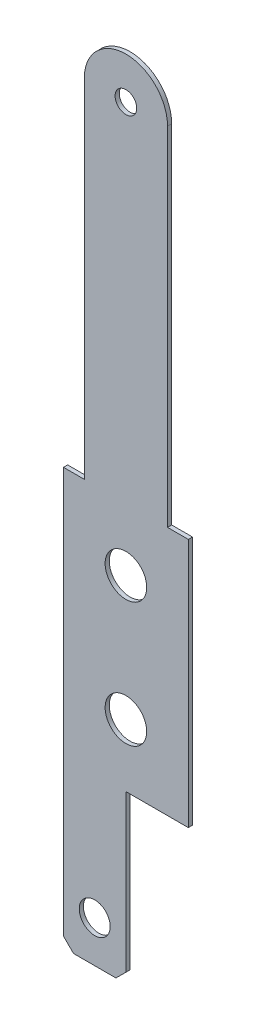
ISO-10303-21;
HEADER;
FILE_DESCRIPTION(('STEP AP214'),'2;1');
FILE_NAME('part.step','',(''),(''),'','','');
FILE_SCHEMA(('AUTOMOTIVE_DESIGN { 1 0 10303 214 1 1 1 1 }'));
ENDSEC;
DATA;
#1=APPLICATION_CONTEXT('core data for automotive mechanical design processes');
#2=APPLICATION_PROTOCOL_DEFINITION('international standard','automotive_design',2000,#1);
#3=PRODUCT_CONTEXT('',#1,'mechanical');
#4=PRODUCT('Part','Part','',(#3));
#5=PRODUCT_RELATED_PRODUCT_CATEGORY('part','',(#4));
#6=PRODUCT_DEFINITION_FORMATION('','',#4);
#7=PRODUCT_DEFINITION_CONTEXT('part definition',#1,'design');
#8=PRODUCT_DEFINITION('design','',#6,#7);
#9=PRODUCT_DEFINITION_SHAPE('','',#8);
#10=(LENGTH_UNIT() NAMED_UNIT(*) SI_UNIT(.MILLI.,.METRE.));
#11=(NAMED_UNIT(*) PLANE_ANGLE_UNIT() SI_UNIT($,.RADIAN.));
#12=(NAMED_UNIT(*) SI_UNIT($,.STERADIAN.) SOLID_ANGLE_UNIT());
#13=UNCERTAINTY_MEASURE_WITH_UNIT(LENGTH_MEASURE(1.E-05),#10,'distance_accuracy_value','');
#14=(GEOMETRIC_REPRESENTATION_CONTEXT(3) GLOBAL_UNCERTAINTY_ASSIGNED_CONTEXT((#13)) GLOBAL_UNIT_ASSIGNED_CONTEXT((#10,
#11,#12)) REPRESENTATION_CONTEXT('',''));
#15=CARTESIAN_POINT('',(0.,0.,0.));
#16=DIRECTION('',(0.,0.,1.));
#17=DIRECTION('',(1.,0.,0.));
#18=AXIS2_PLACEMENT_3D('',#15,#16,#17);
#19=CARTESIAN_POINT('',(-4.7625,52.451,0.3175));
#20=DIRECTION('',(1.,0.,0.));
#21=DIRECTION('',(0.,1.,0.));
#22=AXIS2_PLACEMENT_3D('',#19,#20,#21);
#23=PLANE('',#22);
#24=DIRECTION('',(0.,0.,1.));
#25=VECTOR('',#24,1.);
#26=CARTESIAN_POINT('',(-4.7625,19.05,-102.369484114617));
#27=LINE('',#26,#25);
#28=CARTESIAN_POINT('',(-4.7625,19.05,0.));
#29=VERTEX_POINT('',#28);
#30=CARTESIAN_POINT('',(-4.7625,19.05,0.3175));
#31=VERTEX_POINT('',#30);
#32=EDGE_CURVE('E156',#29,#31,#27,.T.);
#33=ORIENTED_EDGE('',*,*,#32,.F.);
#34=DIRECTION('',(0.,-1.,0.));
#35=VECTOR('',#34,1.);
#36=CARTESIAN_POINT('',(-4.7625,52.451,0.));
#37=LINE('',#36,#35);
#38=CARTESIAN_POINT('',(-4.76250000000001,-11.938,0.));
#39=VERTEX_POINT('',#38);
#40=EDGE_CURVE('E244',#29,#39,#37,.T.);
#41=ORIENTED_EDGE('',*,*,#40,.T.);
#42=DIRECTION('',(0.,0.,1.));
#43=VECTOR('',#42,1.);
#44=CARTESIAN_POINT('',(-4.76250000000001,-11.938,0.3175));
#45=LINE('',#44,#43);
#46=CARTESIAN_POINT('',(-4.76250000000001,-11.938,0.3175));
#47=VERTEX_POINT('',#46);
#48=EDGE_CURVE('E199',#39,#47,#45,.T.);
#49=ORIENTED_EDGE('',*,*,#48,.T.);
#50=DIRECTION('',(0.,-1.,0.));
#51=VECTOR('',#50,1.);
#52=CARTESIAN_POINT('',(-4.7625,52.451,0.3175));
#53=LINE('',#52,#51);
#54=EDGE_CURVE('E225',#31,#47,#53,.T.);
#55=ORIENTED_EDGE('',*,*,#54,.F.);
#56=EDGE_LOOP('',(#33,#41,#49,#55));
#57=FACE_BOUND('',#56,.T.);
#58=ADVANCED_FACE('F34',(#57),#23,.F.);
#59=CARTESIAN_POINT('',(4.7625,52.451,0.3175));
#60=DIRECTION('',(-1.,0.,0.));
#61=DIRECTION('',(0.,-1.,0.));
#62=AXIS2_PLACEMENT_3D('',#59,#60,#61);
#63=PLANE('',#62);
#64=DIRECTION('',(0.,0.,1.));
#65=VECTOR('',#64,1.);
#66=CARTESIAN_POINT('',(4.7625,19.05,-102.369484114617));
#67=LINE('',#66,#65);
#68=CARTESIAN_POINT('',(4.7625,19.05,0.));
#69=VERTEX_POINT('',#68);
#70=CARTESIAN_POINT('',(4.7625,19.05,0.3175));
#71=VERTEX_POINT('',#70);
#72=EDGE_CURVE('E139',#69,#71,#67,.T.);
#73=ORIENTED_EDGE('',*,*,#72,.T.);
#74=DIRECTION('',(0.,1.,0.));
#75=VECTOR('',#74,1.);
#76=CARTESIAN_POINT('',(4.7625,52.451,0.3175));
#77=LINE('',#76,#75);
#78=CARTESIAN_POINT('',(4.76250000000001,0.,0.3175));
#79=VERTEX_POINT('',#78);
#80=EDGE_CURVE('E233',#79,#71,#77,.T.);
#81=ORIENTED_EDGE('',*,*,#80,.F.);
#82=DIRECTION('',(0.,0.,-1.));
#83=VECTOR('',#82,1.);
#84=CARTESIAN_POINT('',(4.76250000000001,0.,0.3175));
#85=LINE('',#84,#83);
#86=CARTESIAN_POINT('',(4.76250000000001,0.,0.));
#87=VERTEX_POINT('',#86);
#88=EDGE_CURVE('E243',#79,#87,#85,.T.);
#89=ORIENTED_EDGE('',*,*,#88,.T.);
#90=DIRECTION('',(0.,1.,0.));
#91=VECTOR('',#90,1.);
#92=CARTESIAN_POINT('',(4.7625,52.451,0.));
#93=LINE('',#92,#91);
#94=EDGE_CURVE('E231',#87,#69,#93,.T.);
#95=ORIENTED_EDGE('',*,*,#94,.T.);
#96=EDGE_LOOP('',(#73,#81,#89,#95));
#97=FACE_BOUND('',#96,.T.);
#98=ADVANCED_FACE('F253',(#97),#63,.F.);
#99=CARTESIAN_POINT('',(0.,59.1936714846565,0.3175));
#100=DIRECTION('',(0.,0.,1.));
#101=DIRECTION('',(1.,0.,0.));
#102=AXIS2_PLACEMENT_3D('',#99,#100,#101);
#103=PLANE('',#102);
#104=CARTESIAN_POINT('',(-2.38125,-9.525,0.3175));
#105=DIRECTION('',(0.,0.,1.));
#106=DIRECTION('',(1.,0.,0.));
#107=AXIS2_PLACEMENT_3D('',#104,#105,#106);
#108=CIRCLE('',#107,1.1811);
#109=CARTESIAN_POINT('',(-1.20015,-9.525,0.3175));
#110=VERTEX_POINT('',#109);
#111=EDGE_CURVE('E166',#110,#110,#108,.T.);
#112=ORIENTED_EDGE('',*,*,#111,.F.);
#113=EDGE_LOOP('',(#112));
#114=FACE_BOUND('',#113,.T.);
#115=CARTESIAN_POINT('',(0.,4.7625,0.3175));
#116=DIRECTION('',(0.,0.,1.));
#117=DIRECTION('',(1.,0.,0.));
#118=AXIS2_PLACEMENT_3D('',#115,#116,#117);
#119=CIRCLE('',#118,1.5875);
#120=CARTESIAN_POINT('',(1.5875,4.7625,0.3175));
#121=VERTEX_POINT('',#120);
#122=EDGE_CURVE('E237',#121,#121,#119,.T.);
#123=ORIENTED_EDGE('',*,*,#122,.F.);
#124=EDGE_LOOP('',(#123));
#125=FACE_BOUND('',#124,.T.);
#126=CARTESIAN_POINT('',(0.,14.2875,0.3175));
#127=DIRECTION('',(0.,0.,1.));
#128=DIRECTION('',(1.,0.,0.));
#129=AXIS2_PLACEMENT_3D('',#126,#127,#128);
#130=CIRCLE('',#129,1.5875);
#131=CARTESIAN_POINT('',(1.5875,14.2875,0.3175));
#132=VERTEX_POINT('',#131);
#133=EDGE_CURVE('E342',#132,#132,#130,.T.);
#134=ORIENTED_EDGE('',*,*,#133,.F.);
#135=EDGE_LOOP('',(#134));
#136=FACE_BOUND('',#135,.T.);
#137=CARTESIAN_POINT('',(0.,45.5676,0.3175));
#138=DIRECTION('',(0.,0.,1.));
#139=DIRECTION('',(1.,0.,0.));
#140=AXIS2_PLACEMENT_3D('',#137,#138,#139);
#141=CIRCLE('',#140,0.825499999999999);
#142=CARTESIAN_POINT('',(0.825499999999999,45.5676,0.3175));
#143=VERTEX_POINT('',#142);
#144=EDGE_CURVE('E189',#143,#143,#141,.T.);
#145=ORIENTED_EDGE('',*,*,#144,.F.);
#146=EDGE_LOOP('',(#145));
#147=FACE_BOUND('',#146,.T.);
#148=DIRECTION('',(0.,-1.,0.));
#149=VECTOR('',#148,1.);
#150=CARTESIAN_POINT('',(-3.175,59.1936714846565,0.3175));
#151=LINE('',#150,#149);
#152=CARTESIAN_POINT('',(-3.175,45.5676,0.317499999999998));
#153=VERTEX_POINT('',#152);
#154=CARTESIAN_POINT('',(-3.175,19.05,0.3175));
#155=VERTEX_POINT('',#154);
#156=EDGE_CURVE('E49',#153,#155,#151,.T.);
#157=ORIENTED_EDGE('',*,*,#156,.T.);
#158=DIRECTION('',(-1.,0.,0.));
#159=VECTOR('',#158,1.);
#160=CARTESIAN_POINT('',(0.,19.05,0.3175));
#161=LINE('',#160,#159);
#162=EDGE_CURVE('E164',#155,#31,#161,.T.);
#163=ORIENTED_EDGE('',*,*,#162,.T.);
#164=ORIENTED_EDGE('',*,*,#54,.T.);
#165=DIRECTION('',(0.707106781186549,-0.707106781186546,0.));
#166=VECTOR('',#165,1.);
#167=CARTESIAN_POINT('',(-37.9470857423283,21.2465857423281,0.3175));
#168=LINE('',#167,#166);
#169=CARTESIAN_POINT('',(-4.00050000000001,-12.7,0.3175));
#170=VERTEX_POINT('',#169);
#171=EDGE_CURVE('E202',#47,#170,#168,.T.);
#172=ORIENTED_EDGE('',*,*,#171,.T.);
#173=DIRECTION('',(1.,0.,0.));
#174=VECTOR('',#173,1.);
#175=CARTESIAN_POINT('',(-4.7625,-12.7,0.3175));
#176=LINE('',#175,#174);
#177=CARTESIAN_POINT('',(-0.762000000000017,-12.7,0.3175));
#178=VERTEX_POINT('',#177);
#179=EDGE_CURVE('E170',#170,#178,#176,.T.);
#180=ORIENTED_EDGE('',*,*,#179,.T.);
#181=DIRECTION('',(-0.707106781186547,-0.707106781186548,0.));
#182=VECTOR('',#181,1.);
#183=CARTESIAN_POINT('',(35.5658357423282,23.6278357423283,0.3175));
#184=LINE('',#183,#182);
#185=CARTESIAN_POINT('',(0.,-11.938,0.3175));
#186=VERTEX_POINT('',#185);
#187=EDGE_CURVE('E200',#178,#186,#184,.F.);
#188=ORIENTED_EDGE('',*,*,#187,.T.);
#189=DIRECTION('',(0.,1.,0.));
#190=VECTOR('',#189,1.);
#191=CARTESIAN_POINT('',(0.,0.,0.3175));
#192=LINE('',#191,#190);
#193=CARTESIAN_POINT('',(0.,0.,0.3175));
#194=VERTEX_POINT('',#193);
#195=EDGE_CURVE('E177',#186,#194,#192,.T.);
#196=ORIENTED_EDGE('',*,*,#195,.T.);
#197=DIRECTION('',(1.,0.,0.));
#198=VECTOR('',#197,1.);
#199=CARTESIAN_POINT('',(-4.76250000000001,0.,0.3175));
#200=LINE('',#199,#198);
#201=EDGE_CURVE('E190',#194,#79,#200,.T.);
#202=ORIENTED_EDGE('',*,*,#201,.T.);
#203=ORIENTED_EDGE('',*,*,#80,.T.);
#204=DIRECTION('',(-1.,0.,0.));
#205=VECTOR('',#204,1.);
#206=CARTESIAN_POINT('',(0.,19.05,0.3175));
#207=LINE('',#206,#205);
#208=CARTESIAN_POINT('',(3.175,19.05,0.3175));
#209=VERTEX_POINT('',#208);
#210=EDGE_CURVE('E159',#71,#209,#207,.T.);
#211=ORIENTED_EDGE('',*,*,#210,.T.);
#212=DIRECTION('',(0.,1.,0.));
#213=VECTOR('',#212,1.);
#214=CARTESIAN_POINT('',(3.175,59.1936714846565,0.3175));
#215=LINE('',#214,#213);
#216=CARTESIAN_POINT('',(3.175,45.5676,0.3175));
#217=VERTEX_POINT('',#216);
#218=EDGE_CURVE('E144',#209,#217,#215,.T.);
#219=ORIENTED_EDGE('',*,*,#218,.T.);
#220=CARTESIAN_POINT('',(0.,45.5676,0.317499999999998));
#221=DIRECTION('',(0.,0.,1.));
#222=DIRECTION('',(1.,0.,0.));
#223=AXIS2_PLACEMENT_3D('',#220,#221,#222);
#224=CIRCLE('',#223,3.175);
#225=EDGE_CURVE('E54',#217,#153,#224,.T.);
#226=ORIENTED_EDGE('',*,*,#225,.T.);
#227=EDGE_LOOP('',(#157,#163,#164,#172,#180,#188,#196,#202,#203,#211,#219,#226));
#228=FACE_BOUND('',#227,.T.);
#229=ADVANCED_FACE('F224',(#114,#125,#136,#147,#228),#103,.T.);
#230=CARTESIAN_POINT('',(0.,59.1936714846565,0.));
#231=DIRECTION('',(0.,0.,1.));
#232=DIRECTION('',(1.,0.,0.));
#233=AXIS2_PLACEMENT_3D('',#230,#231,#232);
#234=PLANE('',#233);
#235=CARTESIAN_POINT('',(-2.38125,-9.525,0.));
#236=DIRECTION('',(0.,0.,1.));
#237=DIRECTION('',(1.,0.,0.));
#238=AXIS2_PLACEMENT_3D('',#235,#236,#237);
#239=CIRCLE('',#238,1.1811);
#240=CARTESIAN_POINT('',(-1.20015,-9.525,0.));
#241=VERTEX_POINT('',#240);
#242=EDGE_CURVE('E167',#241,#241,#239,.T.);
#243=ORIENTED_EDGE('',*,*,#242,.T.);
#244=EDGE_LOOP('',(#243));
#245=FACE_BOUND('',#244,.T.);
#246=CARTESIAN_POINT('',(0.,4.7625,0.));
#247=DIRECTION('',(0.,0.,1.));
#248=DIRECTION('',(1.,0.,0.));
#249=AXIS2_PLACEMENT_3D('',#246,#247,#248);
#250=CIRCLE('',#249,1.5875);
#251=CARTESIAN_POINT('',(1.5875,4.7625,0.));
#252=VERTEX_POINT('',#251);
#253=EDGE_CURVE('E246',#252,#252,#250,.T.);
#254=ORIENTED_EDGE('',*,*,#253,.T.);
#255=EDGE_LOOP('',(#254));
#256=FACE_BOUND('',#255,.T.);
#257=CARTESIAN_POINT('',(0.,14.2875,0.));
#258=DIRECTION('',(0.,0.,1.));
#259=DIRECTION('',(1.,0.,0.));
#260=AXIS2_PLACEMENT_3D('',#257,#258,#259);
#261=CIRCLE('',#260,1.5875);
#262=CARTESIAN_POINT('',(1.5875,14.2875,0.));
#263=VERTEX_POINT('',#262);
#264=EDGE_CURVE('E339',#263,#263,#261,.T.);
#265=ORIENTED_EDGE('',*,*,#264,.T.);
#266=EDGE_LOOP('',(#265));
#267=FACE_BOUND('',#266,.T.);
#268=CARTESIAN_POINT('',(0.,45.5676,0.));
#269=DIRECTION('',(0.,0.,1.));
#270=DIRECTION('',(1.,0.,0.));
#271=AXIS2_PLACEMENT_3D('',#268,#269,#270);
#272=CIRCLE('',#271,0.825499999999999);
#273=CARTESIAN_POINT('',(0.825499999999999,45.5676,0.));
#274=VERTEX_POINT('',#273);
#275=EDGE_CURVE('E182',#274,#274,#272,.T.);
#276=ORIENTED_EDGE('',*,*,#275,.T.);
#277=EDGE_LOOP('',(#276));
#278=FACE_BOUND('',#277,.T.);
#279=DIRECTION('',(-1.,0.,0.));
#280=VECTOR('',#279,1.);
#281=CARTESIAN_POINT('',(0.,19.05,0.));
#282=LINE('',#281,#280);
#283=CARTESIAN_POINT('',(-3.175,19.05,0.));
#284=VERTEX_POINT('',#283);
#285=EDGE_CURVE('E11',#284,#29,#282,.T.);
#286=ORIENTED_EDGE('',*,*,#285,.F.);
#287=DIRECTION('',(0.,-1.,0.));
#288=VECTOR('',#287,1.);
#289=CARTESIAN_POINT('',(-3.175,59.1936714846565,0.));
#290=LINE('',#289,#288);
#291=CARTESIAN_POINT('',(-3.175,45.5676,0.));
#292=VERTEX_POINT('',#291);
#293=EDGE_CURVE('E42',#292,#284,#290,.T.);
#294=ORIENTED_EDGE('',*,*,#293,.F.);
#295=CARTESIAN_POINT('',(0.,45.5676,0.));
#296=DIRECTION('',(0.,0.,1.));
#297=DIRECTION('',(1.,0.,0.));
#298=AXIS2_PLACEMENT_3D('',#295,#296,#297);
#299=CIRCLE('',#298,3.175);
#300=CARTESIAN_POINT('',(3.175,45.5676,0.));
#301=VERTEX_POINT('',#300);
#302=EDGE_CURVE('E127',#301,#292,#299,.T.);
#303=ORIENTED_EDGE('',*,*,#302,.F.);
#304=DIRECTION('',(0.,1.,0.));
#305=VECTOR('',#304,1.);
#306=CARTESIAN_POINT('',(3.175,59.1936714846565,0.));
#307=LINE('',#306,#305);
#308=CARTESIAN_POINT('',(3.175,19.05,0.));
#309=VERTEX_POINT('',#308);
#310=EDGE_CURVE('E120',#309,#301,#307,.T.);
#311=ORIENTED_EDGE('',*,*,#310,.F.);
#312=DIRECTION('',(-1.,0.,0.));
#313=VECTOR('',#312,1.);
#314=CARTESIAN_POINT('',(0.,19.05,0.));
#315=LINE('',#314,#313);
#316=EDGE_CURVE('E124',#69,#309,#315,.T.);
#317=ORIENTED_EDGE('',*,*,#316,.F.);
#318=ORIENTED_EDGE('',*,*,#94,.F.);
#319=DIRECTION('',(1.,0.,0.));
#320=VECTOR('',#319,1.);
#321=CARTESIAN_POINT('',(-4.76250000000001,0.,0.));
#322=LINE('',#321,#320);
#323=CARTESIAN_POINT('',(0.,0.,0.));
#324=VERTEX_POINT('',#323);
#325=EDGE_CURVE('E234',#324,#87,#322,.T.);
#326=ORIENTED_EDGE('',*,*,#325,.F.);
#327=DIRECTION('',(0.,1.,0.));
#328=VECTOR('',#327,1.);
#329=CARTESIAN_POINT('',(0.,0.,0.));
#330=LINE('',#329,#328);
#331=CARTESIAN_POINT('',(0.,-11.938,0.));
#332=VERTEX_POINT('',#331);
#333=EDGE_CURVE('E176',#332,#324,#330,.T.);
#334=ORIENTED_EDGE('',*,*,#333,.F.);
#335=DIRECTION('',(0.707106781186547,0.707106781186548,0.));
#336=VECTOR('',#335,1.);
#337=CARTESIAN_POINT('',(-0.76200000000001,-12.7,0.));
#338=LINE('',#337,#336);
#339=CARTESIAN_POINT('',(-0.762000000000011,-12.7,0.));
#340=VERTEX_POINT('',#339);
#341=EDGE_CURVE('E209',#332,#340,#338,.F.);
#342=ORIENTED_EDGE('',*,*,#341,.T.);
#343=DIRECTION('',(1.,0.,0.));
#344=VECTOR('',#343,1.);
#345=CARTESIAN_POINT('',(-4.7625,-12.7,0.));
#346=LINE('',#345,#344);
#347=CARTESIAN_POINT('',(-4.00050000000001,-12.7,0.));
#348=VERTEX_POINT('',#347);
#349=EDGE_CURVE('E173',#348,#340,#346,.T.);
#350=ORIENTED_EDGE('',*,*,#349,.F.);
#351=DIRECTION('',(-0.707106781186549,0.707106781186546,0.));
#352=VECTOR('',#351,1.);
#353=CARTESIAN_POINT('',(-4.76250000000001,-11.938,0.));
#354=LINE('',#353,#352);
#355=EDGE_CURVE('E212',#348,#39,#354,.T.);
#356=ORIENTED_EDGE('',*,*,#355,.T.);
#357=ORIENTED_EDGE('',*,*,#40,.F.);
#358=EDGE_LOOP('',(#286,#294,#303,#311,#317,#318,#326,#334,#342,#350,#356,#357));
#359=FACE_BOUND('',#358,.T.);
#360=ADVANCED_FACE('F122',(#245,#256,#267,#278,#359),#234,.F.);
#361=CARTESIAN_POINT('',(-4.76250000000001,0.,0.3175));
#362=DIRECTION('',(0.,1.,0.));
#363=DIRECTION('',(0.,0.,1.));
#364=AXIS2_PLACEMENT_3D('',#361,#362,#363);
#365=PLANE('',#364);
#366=DIRECTION('',(0.,0.,1.));
#367=VECTOR('',#366,1.);
#368=CARTESIAN_POINT('',(0.,0.,0.));
#369=LINE('',#368,#367);
#370=EDGE_CURVE('E185',#324,#194,#369,.T.);
#371=ORIENTED_EDGE('',*,*,#370,.F.);
#372=ORIENTED_EDGE('',*,*,#325,.T.);
#373=ORIENTED_EDGE('',*,*,#88,.F.);
#374=ORIENTED_EDGE('',*,*,#201,.F.);
#375=EDGE_LOOP('',(#371,#372,#373,#374));
#376=FACE_BOUND('',#375,.T.);
#377=ADVANCED_FACE('F260',(#376),#365,.F.);
#378=CARTESIAN_POINT('',(0.,4.7625,0.));
#379=DIRECTION('',(0.,0.,1.));
#380=DIRECTION('',(1.,0.,0.));
#381=AXIS2_PLACEMENT_3D('',#378,#379,#380);
#382=CYLINDRICAL_SURFACE('',#381,1.5875);
#383=ORIENTED_EDGE('',*,*,#253,.F.);
#384=EDGE_LOOP('',(#383));
#385=FACE_BOUND('',#384,.T.);
#386=ORIENTED_EDGE('',*,*,#122,.T.);
#387=EDGE_LOOP('',(#386));
#388=FACE_BOUND('',#387,.T.);
#389=ADVANCED_FACE('F318',(#385,#388),#382,.F.);
#390=CARTESIAN_POINT('',(0.,14.2875,0.));
#391=DIRECTION('',(0.,0.,1.));
#392=DIRECTION('',(1.,0.,0.));
#393=AXIS2_PLACEMENT_3D('',#390,#391,#392);
#394=CYLINDRICAL_SURFACE('',#393,1.5875);
#395=ORIENTED_EDGE('',*,*,#264,.F.);
#396=EDGE_LOOP('',(#395));
#397=FACE_BOUND('',#396,.T.);
#398=ORIENTED_EDGE('',*,*,#133,.T.);
#399=EDGE_LOOP('',(#398));
#400=FACE_BOUND('',#399,.T.);
#401=ADVANCED_FACE('F314',(#397,#400),#394,.F.);
#402=CARTESIAN_POINT('',(0.,45.5676,0.));
#403=DIRECTION('',(0.,0.,1.));
#404=DIRECTION('',(1.,0.,0.));
#405=AXIS2_PLACEMENT_3D('',#402,#403,#404);
#406=CYLINDRICAL_SURFACE('',#405,0.825499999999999);
#407=ORIENTED_EDGE('',*,*,#275,.F.);
#408=EDGE_LOOP('',(#407));
#409=FACE_BOUND('',#408,.T.);
#410=ORIENTED_EDGE('',*,*,#144,.T.);
#411=EDGE_LOOP('',(#410));
#412=FACE_BOUND('',#411,.T.);
#413=ADVANCED_FACE('F310',(#409,#412),#406,.F.);
#414=CARTESIAN_POINT('',(0.,0.,0.));
#415=DIRECTION('',(1.,0.,0.));
#416=DIRECTION('',(0.,1.,0.));
#417=AXIS2_PLACEMENT_3D('',#414,#415,#416);
#418=PLANE('',#417);
#419=ORIENTED_EDGE('',*,*,#195,.F.);
#420=DIRECTION('',(0.,0.,-1.));
#421=VECTOR('',#420,1.);
#422=CARTESIAN_POINT('',(0.,-11.938,0.));
#423=LINE('',#422,#421);
#424=EDGE_CURVE('E140',#186,#332,#423,.T.);
#425=ORIENTED_EDGE('',*,*,#424,.T.);
#426=ORIENTED_EDGE('',*,*,#333,.T.);
#427=ORIENTED_EDGE('',*,*,#370,.T.);
#428=EDGE_LOOP('',(#419,#425,#426,#427));
#429=FACE_BOUND('',#428,.T.);
#430=ADVANCED_FACE('F263',(#429),#418,.T.);
#431=CARTESIAN_POINT('',(-4.7625,-12.7,0.));
#432=DIRECTION('',(0.,-1.,0.));
#433=DIRECTION('',(0.,0.,-1.));
#434=AXIS2_PLACEMENT_3D('',#431,#432,#433);
#435=PLANE('',#434);
#436=ORIENTED_EDGE('',*,*,#179,.F.);
#437=DIRECTION('',(0.,0.,-1.));
#438=VECTOR('',#437,1.);
#439=CARTESIAN_POINT('',(-4.00050000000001,-12.7,0.));
#440=LINE('',#439,#438);
#441=EDGE_CURVE('E207',#170,#348,#440,.T.);
#442=ORIENTED_EDGE('',*,*,#441,.T.);
#443=ORIENTED_EDGE('',*,*,#349,.T.);
#444=DIRECTION('',(0.,0.,1.));
#445=VECTOR('',#444,1.);
#446=CARTESIAN_POINT('',(-0.76200000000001,-12.7,0.));
#447=LINE('',#446,#445);
#448=EDGE_CURVE('E204',#340,#178,#447,.T.);
#449=ORIENTED_EDGE('',*,*,#448,.T.);
#450=EDGE_LOOP('',(#436,#442,#443,#449));
#451=FACE_BOUND('',#450,.T.);
#452=ADVANCED_FACE('F271',(#451),#435,.T.);
#453=CARTESIAN_POINT('',(-2.38125,-9.525,0.));
#454=DIRECTION('',(0.,0.,1.));
#455=DIRECTION('',(1.,0.,0.));
#456=AXIS2_PLACEMENT_3D('',#453,#454,#455);
#457=CYLINDRICAL_SURFACE('',#456,1.1811);
#458=ORIENTED_EDGE('',*,*,#242,.F.);
#459=EDGE_LOOP('',(#458));
#460=FACE_BOUND('',#459,.T.);
#461=ORIENTED_EDGE('',*,*,#111,.T.);
#462=EDGE_LOOP('',(#461));
#463=FACE_BOUND('',#462,.T.);
#464=ADVANCED_FACE('F294',(#460,#463),#457,.F.);
#465=CARTESIAN_POINT('',(-4.76250000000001,-11.938,0.3175));
#466=DIRECTION('',(-0.707106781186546,-0.707106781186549,0.));
#467=DIRECTION('',(0.,0.,-1.));
#468=AXIS2_PLACEMENT_3D('',#465,#466,#467);
#469=PLANE('',#468);
#470=ORIENTED_EDGE('',*,*,#355,.F.);
#471=ORIENTED_EDGE('',*,*,#441,.F.);
#472=ORIENTED_EDGE('',*,*,#171,.F.);
#473=ORIENTED_EDGE('',*,*,#48,.F.);
#474=EDGE_LOOP('',(#470,#471,#472,#473));
#475=FACE_BOUND('',#474,.T.);
#476=ADVANCED_FACE('F274',(#475),#469,.T.);
#477=CARTESIAN_POINT('',(-0.76200000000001,-12.7,0.));
#478=DIRECTION('',(-0.707106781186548,0.707106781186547,0.));
#479=DIRECTION('',(0.,0.,1.));
#480=AXIS2_PLACEMENT_3D('',#477,#478,#479);
#481=PLANE('',#480);
#482=ORIENTED_EDGE('',*,*,#341,.F.);
#483=ORIENTED_EDGE('',*,*,#424,.F.);
#484=ORIENTED_EDGE('',*,*,#187,.F.);
#485=ORIENTED_EDGE('',*,*,#448,.F.);
#486=EDGE_LOOP('',(#482,#483,#484,#485));
#487=FACE_BOUND('',#486,.T.);
#488=ADVANCED_FACE('F36',(#487),#481,.F.);
#489=CARTESIAN_POINT('',(-4.7625,19.05,-102.369484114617));
#490=DIRECTION('',(0.,1.,0.));
#491=DIRECTION('',(-1.,0.,0.));
#492=AXIS2_PLACEMENT_3D('',#489,#490,#491);
#493=PLANE('',#492);
#494=ORIENTED_EDGE('',*,*,#162,.F.);
#495=DIRECTION('',(0.,0.,1.));
#496=VECTOR('',#495,1.);
#497=CARTESIAN_POINT('',(-3.175,19.05,-102.369484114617));
#498=LINE('',#497,#496);
#499=EDGE_CURVE('E153',#284,#155,#498,.T.);
#500=ORIENTED_EDGE('',*,*,#499,.F.);
#501=ORIENTED_EDGE('',*,*,#285,.T.);
#502=ORIENTED_EDGE('',*,*,#32,.T.);
#503=EDGE_LOOP('',(#494,#500,#501,#502));
#504=FACE_BOUND('',#503,.T.);
#505=ADVANCED_FACE('F222',(#504),#493,.T.);
#506=CARTESIAN_POINT('',(-3.175,19.05,-102.369484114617));
#507=DIRECTION('',(-1.,0.,0.));
#508=DIRECTION('',(0.,0.,1.));
#509=AXIS2_PLACEMENT_3D('',#506,#507,#508);
#510=PLANE('',#509);
#511=ORIENTED_EDGE('',*,*,#156,.F.);
#512=DIRECTION('',(0.,0.,1.));
#513=VECTOR('',#512,1.);
#514=CARTESIAN_POINT('',(-3.175,45.5676,-102.369484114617));
#515=LINE('',#514,#513);
#516=EDGE_CURVE('E147',#292,#153,#515,.T.);
#517=ORIENTED_EDGE('',*,*,#516,.F.);
#518=ORIENTED_EDGE('',*,*,#293,.T.);
#519=ORIENTED_EDGE('',*,*,#499,.T.);
#520=EDGE_LOOP('',(#511,#517,#518,#519));
#521=FACE_BOUND('',#520,.T.);
#522=ADVANCED_FACE('F220',(#521),#510,.T.);
#523=CARTESIAN_POINT('',(0.,45.5676,-102.369484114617));
#524=DIRECTION('',(0.,0.,1.));
#525=DIRECTION('',(1.,0.,0.));
#526=AXIS2_PLACEMENT_3D('',#523,#524,#525);
#527=CYLINDRICAL_SURFACE('',#526,3.175);
#528=ORIENTED_EDGE('',*,*,#225,.F.);
#529=DIRECTION('',(0.,0.,1.));
#530=VECTOR('',#529,1.);
#531=CARTESIAN_POINT('',(3.175,45.5676,-102.369484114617));
#532=LINE('',#531,#530);
#533=EDGE_CURVE('E145',#301,#217,#532,.T.);
#534=ORIENTED_EDGE('',*,*,#533,.F.);
#535=ORIENTED_EDGE('',*,*,#302,.T.);
#536=ORIENTED_EDGE('',*,*,#516,.T.);
#537=EDGE_LOOP('',(#528,#534,#535,#536));
#538=FACE_BOUND('',#537,.T.);
#539=ADVANCED_FACE('F276',(#538),#527,.T.);
#540=CARTESIAN_POINT('',(3.175,19.05,-102.369484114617));
#541=DIRECTION('',(1.,0.,0.));
#542=DIRECTION('',(0.,0.,-1.));
#543=AXIS2_PLACEMENT_3D('',#540,#541,#542);
#544=PLANE('',#543);
#545=ORIENTED_EDGE('',*,*,#218,.F.);
#546=DIRECTION('',(0.,0.,1.));
#547=VECTOR('',#546,1.);
#548=CARTESIAN_POINT('',(3.175,19.05,-102.369484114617));
#549=LINE('',#548,#547);
#550=EDGE_CURVE('E138',#309,#209,#549,.T.);
#551=ORIENTED_EDGE('',*,*,#550,.F.);
#552=ORIENTED_EDGE('',*,*,#310,.T.);
#553=ORIENTED_EDGE('',*,*,#533,.T.);
#554=EDGE_LOOP('',(#545,#551,#552,#553));
#555=FACE_BOUND('',#554,.T.);
#556=ADVANCED_FACE('F143',(#555),#544,.T.);
#557=CARTESIAN_POINT('',(4.7625,19.05,-102.369484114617));
#558=DIRECTION('',(0.,1.,0.));
#559=DIRECTION('',(-1.,0.,0.));
#560=AXIS2_PLACEMENT_3D('',#557,#558,#559);
#561=PLANE('',#560);
#562=ORIENTED_EDGE('',*,*,#210,.F.);
#563=ORIENTED_EDGE('',*,*,#72,.F.);
#564=ORIENTED_EDGE('',*,*,#316,.T.);
#565=ORIENTED_EDGE('',*,*,#550,.T.);
#566=EDGE_LOOP('',(#562,#563,#564,#565));
#567=FACE_BOUND('',#566,.T.);
#568=ADVANCED_FACE('F137',(#567),#561,.T.);
#569=CLOSED_SHELL('',(#58,#98,#229,#360,#377,#389,#401,#413,#430,#452,#464,#476,#488,#505,#522,
#539,#556,#568));
#570=MANIFOLD_SOLID_BREP('B2',#569);
#571=ADVANCED_BREP_SHAPE_REPRESENTATION('',(#18,#570),#14);
#572=SHAPE_DEFINITION_REPRESENTATION(#9,#571);
ENDSEC;
END-ISO-10303-21;
